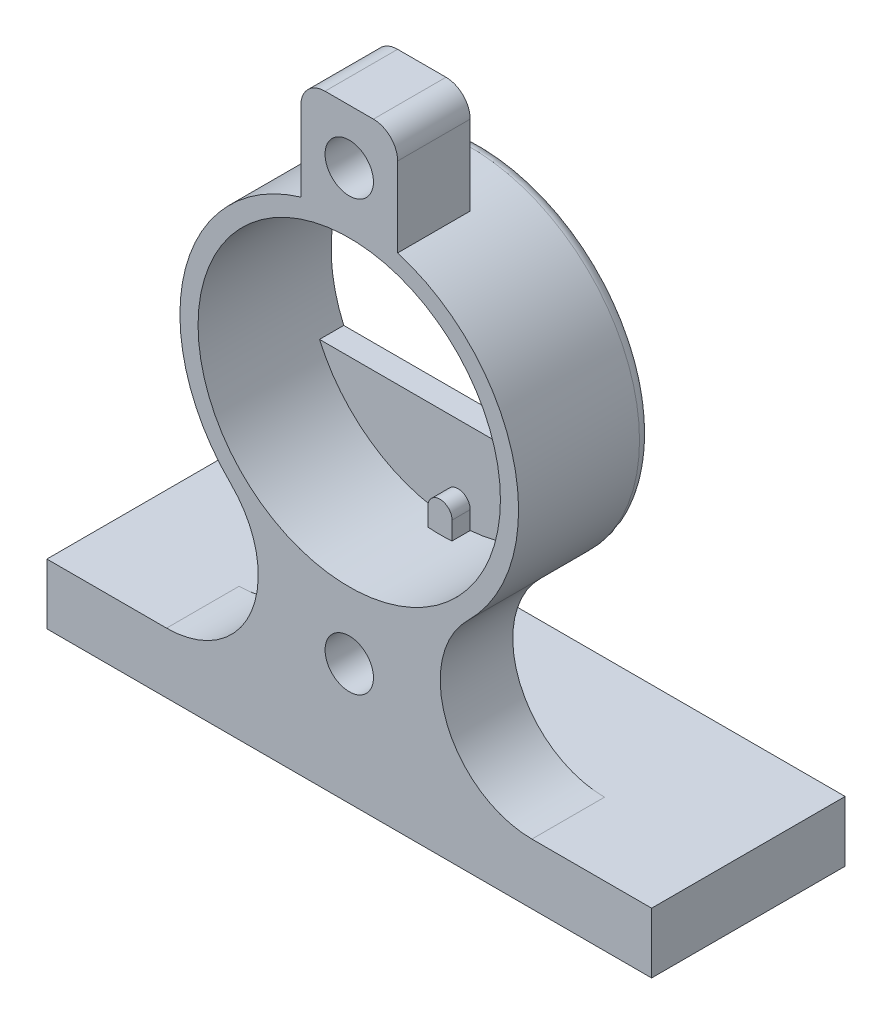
ISO-10303-21;
HEADER;
FILE_DESCRIPTION(('STEP AP214'),'2;1');
FILE_NAME('part.step','',(''),(''),'','','');
FILE_SCHEMA(('AUTOMOTIVE_DESIGN { 1 0 10303 214 1 1 1 1 }'));
ENDSEC;
DATA;
#1=APPLICATION_CONTEXT('core data for automotive mechanical design processes');
#2=APPLICATION_PROTOCOL_DEFINITION('international standard','automotive_design',2000,#1);
#3=PRODUCT_CONTEXT('',#1,'mechanical');
#4=PRODUCT('Part','Part','',(#3));
#5=PRODUCT_RELATED_PRODUCT_CATEGORY('part','',(#4));
#6=PRODUCT_DEFINITION_FORMATION('','',#4);
#7=PRODUCT_DEFINITION_CONTEXT('part definition',#1,'design');
#8=PRODUCT_DEFINITION('design','',#6,#7);
#9=PRODUCT_DEFINITION_SHAPE('','',#8);
#10=(LENGTH_UNIT() NAMED_UNIT(*) SI_UNIT(.MILLI.,.METRE.));
#11=(NAMED_UNIT(*) PLANE_ANGLE_UNIT() SI_UNIT($,.RADIAN.));
#12=(NAMED_UNIT(*) SI_UNIT($,.STERADIAN.) SOLID_ANGLE_UNIT());
#13=UNCERTAINTY_MEASURE_WITH_UNIT(LENGTH_MEASURE(1.E-05),#10,'distance_accuracy_value','');
#14=(GEOMETRIC_REPRESENTATION_CONTEXT(3) GLOBAL_UNCERTAINTY_ASSIGNED_CONTEXT((#13)) GLOBAL_UNIT_ASSIGNED_CONTEXT((#10,
#11,#12)) REPRESENTATION_CONTEXT('',''));
#15=CARTESIAN_POINT('',(0.,0.,0.));
#16=DIRECTION('',(0.,0.,1.));
#17=DIRECTION('',(1.,0.,0.));
#18=AXIS2_PLACEMENT_3D('',#15,#16,#17);
#19=CARTESIAN_POINT('',(0.,0.,5.));
#20=DIRECTION('',(0.,0.,-1.));
#21=DIRECTION('',(-1.,0.,0.));
#22=AXIS2_PLACEMENT_3D('',#19,#20,#21);
#23=PLANE('',#22);
#24=CARTESIAN_POINT('',(0.,-18.,5.));
#25=DIRECTION('',(0.,0.,-1.));
#26=DIRECTION('',(-1.,0.,0.));
#27=AXIS2_PLACEMENT_3D('',#24,#25,#26);
#28=CIRCLE('',#27,3.25);
#29=CARTESIAN_POINT('',(-3.25,-18.,5.));
#30=VERTEX_POINT('',#29);
#31=EDGE_CURVE('E296',#30,#30,#28,.T.);
#32=ORIENTED_EDGE('',*,*,#31,.F.);
#33=EDGE_LOOP('',(#32));
#34=FACE_BOUND('',#33,.T.);
#35=CARTESIAN_POINT('',(15.1051867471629,-15.4166666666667,5.));
#36=DIRECTION('',(0.,0.,-1.));
#37=DIRECTION('',(-1.,0.,0.));
#38=AXIS2_PLACEMENT_3D('',#35,#36,#37);
#39=CIRCLE('',#38,7.58333333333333);
#40=CARTESIAN_POINT('',(9.79795897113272,-10.,5.));
#41=VERTEX_POINT('',#40);
#42=CARTESIAN_POINT('',(15.1051867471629,-23.,5.));
#43=VERTEX_POINT('',#42);
#44=EDGE_CURVE('E355',#41,#43,#39,.F.);
#45=ORIENTED_EDGE('',*,*,#44,.T.);
#46=DIRECTION('',(-1.,0.,0.));
#47=VECTOR('',#46,1.);
#48=CARTESIAN_POINT('',(0.,-23.,5.));
#49=LINE('',#48,#47);
#50=CARTESIAN_POINT('',(-15.1051867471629,-23.,5.));
#51=VERTEX_POINT('',#50);
#52=EDGE_CURVE('E12',#43,#51,#49,.T.);
#53=ORIENTED_EDGE('',*,*,#52,.T.);
#54=CARTESIAN_POINT('',(-15.1051867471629,-15.4166666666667,5.));
#55=DIRECTION('',(0.,0.,-1.));
#56=DIRECTION('',(-1.,0.,0.));
#57=AXIS2_PLACEMENT_3D('',#54,#55,#56);
#58=CIRCLE('',#57,7.58333333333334);
#59=CARTESIAN_POINT('',(-9.79795897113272,-9.99999999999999,5.));
#60=VERTEX_POINT('',#59);
#61=EDGE_CURVE('E353',#51,#60,#58,.F.);
#62=ORIENTED_EDGE('',*,*,#61,.T.);
#63=CARTESIAN_POINT('',(0.,0.,5.));
#64=DIRECTION('',(0.,0.,1.));
#65=DIRECTION('',(-1.,0.,0.));
#66=AXIS2_PLACEMENT_3D('',#63,#64,#65);
#67=CIRCLE('',#66,14.);
#68=EDGE_CURVE('E351',#60,#41,#67,.T.);
#69=ORIENTED_EDGE('',*,*,#68,.T.);
#70=EDGE_LOOP('',(#45,#53,#62,#69));
#71=FACE_BOUND('',#70,.T.);
#72=ADVANCED_FACE('F35',(#34,#71),#23,.T.);
#73=CARTESIAN_POINT('',(0.,0.,-35.3553390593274));
#74=DIRECTION('',(0.,0.,1.));
#75=DIRECTION('',(1.,0.,0.));
#76=AXIS2_PLACEMENT_3D('',#73,#74,#75);
#77=CYLINDRICAL_SURFACE('',#76,12.5);
#78=CARTESIAN_POINT('',(0.,0.,11.));
#79=DIRECTION('',(0.,0.,1.));
#80=DIRECTION('',(1.,0.,0.));
#81=AXIS2_PLACEMENT_3D('',#78,#79,#80);
#82=CIRCLE('',#81,12.5);
#83=CARTESIAN_POINT('',(12.5,0.,11.));
#84=VERTEX_POINT('',#83);
#85=EDGE_CURVE('E415',#84,#84,#82,.T.);
#86=ORIENTED_EDGE('',*,*,#85,.T.);
#87=EDGE_LOOP('',(#86));
#88=FACE_BOUND('',#87,.T.);
#89=DIRECTION('',(0.,0.,1.));
#90=VECTOR('',#89,1.);
#91=CARTESIAN_POINT('',(-1.,12.4599357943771,-35.3553390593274));
#92=LINE('',#91,#90);
#93=CARTESIAN_POINT('',(-1.,12.4599357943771,3.5));
#94=VERTEX_POINT('',#93);
#95=CARTESIAN_POINT('',(-1.,12.4599357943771,2.));
#96=VERTEX_POINT('',#95);
#97=EDGE_CURVE('E55',#94,#96,#92,.F.);
#98=ORIENTED_EDGE('',*,*,#97,.F.);
#99=CARTESIAN_POINT('',(0.,0.,3.5));
#100=DIRECTION('',(0.,0.,1.));
#101=DIRECTION('',(1.,0.,0.));
#102=AXIS2_PLACEMENT_3D('',#99,#100,#101);
#103=CIRCLE('',#102,12.5);
#104=CARTESIAN_POINT('',(1.,12.4599357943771,3.5));
#105=VERTEX_POINT('',#104);
#106=EDGE_CURVE('E50',#94,#105,#103,.F.);
#107=ORIENTED_EDGE('',*,*,#106,.T.);
#108=DIRECTION('',(0.,0.,1.));
#109=VECTOR('',#108,1.);
#110=CARTESIAN_POINT('',(1.,12.4599357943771,-35.3553390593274));
#111=LINE('',#110,#109);
#112=CARTESIAN_POINT('',(1.,12.4599357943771,2.));
#113=VERTEX_POINT('',#112);
#114=EDGE_CURVE('E260',#113,#105,#111,.T.);
#115=ORIENTED_EDGE('',*,*,#114,.F.);
#116=CARTESIAN_POINT('',(0.,0.,2.));
#117=DIRECTION('',(0.,0.,-1.));
#118=DIRECTION('',(-1.,0.,0.));
#119=AXIS2_PLACEMENT_3D('',#116,#117,#118);
#120=CIRCLE('',#119,12.5);
#121=CARTESIAN_POINT('',(11.4564392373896,5.,2.));
#122=VERTEX_POINT('',#121);
#123=EDGE_CURVE('E403',#122,#113,#120,.F.);
#124=ORIENTED_EDGE('',*,*,#123,.F.);
#125=DIRECTION('',(0.,0.,1.));
#126=VECTOR('',#125,1.);
#127=CARTESIAN_POINT('',(11.4564392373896,5.,0.));
#128=LINE('',#127,#126);
#129=CARTESIAN_POINT('',(11.4564392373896,5.,0.));
#130=VERTEX_POINT('',#129);
#131=EDGE_CURVE('E385',#130,#122,#128,.T.);
#132=ORIENTED_EDGE('',*,*,#131,.F.);
#133=CARTESIAN_POINT('',(0.,0.,0.));
#134=DIRECTION('',(0.,0.,1.));
#135=DIRECTION('',(1.,0.,0.));
#136=AXIS2_PLACEMENT_3D('',#133,#134,#135);
#137=CIRCLE('',#136,12.5);
#138=CARTESIAN_POINT('',(11.4564392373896,-5.,0.));
#139=VERTEX_POINT('',#138);
#140=EDGE_CURVE('E365',#139,#130,#137,.T.);
#141=ORIENTED_EDGE('',*,*,#140,.F.);
#142=DIRECTION('',(0.,0.,1.));
#143=VECTOR('',#142,1.);
#144=CARTESIAN_POINT('',(11.4564392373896,-5.,0.));
#145=LINE('',#144,#143);
#146=CARTESIAN_POINT('',(11.4564392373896,-5.,2.));
#147=VERTEX_POINT('',#146);
#148=EDGE_CURVE('E382',#139,#147,#145,.T.);
#149=ORIENTED_EDGE('',*,*,#148,.T.);
#150=CARTESIAN_POINT('',(1.,-12.4599357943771,2.));
#151=VERTEX_POINT('',#150);
#152=EDGE_CURVE('E399',#151,#147,#120,.F.);
#153=ORIENTED_EDGE('',*,*,#152,.F.);
#154=DIRECTION('',(0.,0.,1.));
#155=VECTOR('',#154,1.);
#156=CARTESIAN_POINT('',(1.,-12.4599357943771,-35.3553390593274));
#157=LINE('',#156,#155);
#158=CARTESIAN_POINT('',(1.,-12.4599357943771,3.5));
#159=VERTEX_POINT('',#158);
#160=EDGE_CURVE('E43',#159,#151,#157,.F.);
#161=ORIENTED_EDGE('',*,*,#160,.F.);
#162=CARTESIAN_POINT('',(0.,0.,3.5));
#163=DIRECTION('',(0.,0.,-1.));
#164=DIRECTION('',(-1.,0.,0.));
#165=AXIS2_PLACEMENT_3D('',#162,#163,#164);
#166=CIRCLE('',#165,12.5);
#167=CARTESIAN_POINT('',(-1.,-12.4599357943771,3.5));
#168=VERTEX_POINT('',#167);
#169=EDGE_CURVE('E394',#168,#159,#166,.F.);
#170=ORIENTED_EDGE('',*,*,#169,.F.);
#171=DIRECTION('',(0.,0.,1.));
#172=VECTOR('',#171,1.);
#173=CARTESIAN_POINT('',(-1.,-12.4599357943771,-35.3553390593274));
#174=LINE('',#173,#172);
#175=CARTESIAN_POINT('',(-1.,-12.4599357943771,2.));
#176=VERTEX_POINT('',#175);
#177=EDGE_CURVE('E417',#176,#168,#174,.T.);
#178=ORIENTED_EDGE('',*,*,#177,.F.);
#179=CARTESIAN_POINT('',(-11.4564392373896,-5.,2.));
#180=VERTEX_POINT('',#179);
#181=EDGE_CURVE('E402',#180,#176,#120,.F.);
#182=ORIENTED_EDGE('',*,*,#181,.F.);
#183=DIRECTION('',(0.,0.,1.));
#184=VECTOR('',#183,1.);
#185=CARTESIAN_POINT('',(-11.4564392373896,-5.,0.));
#186=LINE('',#185,#184);
#187=CARTESIAN_POINT('',(-11.4564392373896,-5.,0.));
#188=VERTEX_POINT('',#187);
#189=EDGE_CURVE('E371',#188,#180,#186,.T.);
#190=ORIENTED_EDGE('',*,*,#189,.F.);
#191=CARTESIAN_POINT('',(0.,0.,0.));
#192=DIRECTION('',(0.,0.,1.));
#193=DIRECTION('',(-1.,0.,0.));
#194=AXIS2_PLACEMENT_3D('',#191,#192,#193);
#195=CIRCLE('',#194,12.5);
#196=CARTESIAN_POINT('',(-11.4564392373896,5.,0.));
#197=VERTEX_POINT('',#196);
#198=EDGE_CURVE('E358',#197,#188,#195,.T.);
#199=ORIENTED_EDGE('',*,*,#198,.F.);
#200=DIRECTION('',(0.,0.,1.));
#201=VECTOR('',#200,1.);
#202=CARTESIAN_POINT('',(-11.4564392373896,5.,0.));
#203=LINE('',#202,#201);
#204=CARTESIAN_POINT('',(-11.4564392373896,5.,2.));
#205=VERTEX_POINT('',#204);
#206=EDGE_CURVE('E544',#197,#205,#203,.T.);
#207=ORIENTED_EDGE('',*,*,#206,.T.);
#208=EDGE_CURVE('E413',#96,#205,#120,.F.);
#209=ORIENTED_EDGE('',*,*,#208,.F.);
#210=EDGE_LOOP('',(#98,#107,#115,#124,#132,#141,#149,#153,#161,#170,#178,#182,#190,#199,#207,#209));
#211=FACE_BOUND('',#210,.T.);
#212=ADVANCED_FACE('F444',(#88,#211),#77,.F.);
#213=CARTESIAN_POINT('',(-15.1051867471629,-15.4166666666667,2.));
#214=DIRECTION('',(0.,0.,-1.));
#215=DIRECTION('',(-1.,0.,0.));
#216=AXIS2_PLACEMENT_3D('',#213,#214,#215);
#217=PLANE('',#216);
#218=DIRECTION('',(0.,-1.,0.));
#219=VECTOR('',#218,1.);
#220=CARTESIAN_POINT('',(-1.,13.9642400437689,2.));
#221=LINE('',#220,#219);
#222=CARTESIAN_POINT('',(-1.00000000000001,10.9642400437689,2.));
#223=VERTEX_POINT('',#222);
#224=EDGE_CURVE('E237',#96,#223,#221,.T.);
#225=ORIENTED_EDGE('',*,*,#224,.F.);
#226=ORIENTED_EDGE('',*,*,#208,.T.);
#227=DIRECTION('',(-1.,0.,0.));
#228=VECTOR('',#227,1.);
#229=CARTESIAN_POINT('',(-11.4564392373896,5.,2.));
#230=LINE('',#229,#228);
#231=EDGE_CURVE('E362',#122,#205,#230,.T.);
#232=ORIENTED_EDGE('',*,*,#231,.F.);
#233=ORIENTED_EDGE('',*,*,#123,.T.);
#234=DIRECTION('',(0.,1.,0.));
#235=VECTOR('',#234,1.);
#236=CARTESIAN_POINT('',(1.,13.9642400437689,2.));
#237=LINE('',#236,#235);
#238=CARTESIAN_POINT('',(1.,10.9642400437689,2.));
#239=VERTEX_POINT('',#238);
#240=EDGE_CURVE('E241',#239,#113,#237,.T.);
#241=ORIENTED_EDGE('',*,*,#240,.F.);
#242=CARTESIAN_POINT('',(0.,10.9642400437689,2.));
#243=DIRECTION('',(0.,0.,1.));
#244=DIRECTION('',(1.,0.,0.));
#245=AXIS2_PLACEMENT_3D('',#242,#243,#244);
#246=CIRCLE('',#245,1.);
#247=EDGE_CURVE('E249',#223,#239,#246,.T.);
#248=ORIENTED_EDGE('',*,*,#247,.F.);
#249=EDGE_LOOP('',(#225,#226,#232,#233,#241,#248));
#250=FACE_BOUND('',#249,.T.);
#251=ADVANCED_FACE('F450',(#250),#217,.F.);
#252=DIRECTION('',(0.,1.,0.));
#253=VECTOR('',#252,1.);
#254=CARTESIAN_POINT('',(1.,-13.9642400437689,2.));
#255=LINE('',#254,#253);
#256=CARTESIAN_POINT('',(0.999999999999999,-10.9642400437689,2.));
#257=VERTEX_POINT('',#256);
#258=EDGE_CURVE('E263',#151,#257,#255,.T.);
#259=ORIENTED_EDGE('',*,*,#258,.F.);
#260=ORIENTED_EDGE('',*,*,#152,.T.);
#261=DIRECTION('',(1.,0.,0.));
#262=VECTOR('',#261,1.);
#263=CARTESIAN_POINT('',(-11.4564392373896,-5.,2.));
#264=LINE('',#263,#262);
#265=EDGE_CURVE('E357',#180,#147,#264,.T.);
#266=ORIENTED_EDGE('',*,*,#265,.F.);
#267=ORIENTED_EDGE('',*,*,#181,.T.);
#268=DIRECTION('',(0.,-1.,0.));
#269=VECTOR('',#268,1.);
#270=CARTESIAN_POINT('',(-1.,-13.9642400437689,2.));
#271=LINE('',#270,#269);
#272=CARTESIAN_POINT('',(-0.999999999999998,-10.9642400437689,2.));
#273=VERTEX_POINT('',#272);
#274=EDGE_CURVE('E267',#273,#176,#271,.T.);
#275=ORIENTED_EDGE('',*,*,#274,.F.);
#276=CARTESIAN_POINT('',(0.,-10.9642400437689,2.));
#277=DIRECTION('',(0.,0.,1.));
#278=DIRECTION('',(-1.,0.,0.));
#279=AXIS2_PLACEMENT_3D('',#276,#277,#278);
#280=CIRCLE('',#279,0.999999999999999);
#281=EDGE_CURVE('E275',#257,#273,#280,.T.);
#282=ORIENTED_EDGE('',*,*,#281,.F.);
#283=EDGE_LOOP('',(#259,#260,#266,#267,#275,#282));
#284=FACE_BOUND('',#283,.T.);
#285=ADVANCED_FACE('F468',(#284),#217,.F.);
#286=CARTESIAN_POINT('',(0.,17.5,-6.73362918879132));
#287=DIRECTION('',(0.,0.,1.));
#288=DIRECTION('',(1.,0.,0.));
#289=AXIS2_PLACEMENT_3D('',#286,#287,#288);
#290=CYLINDRICAL_SURFACE('',#289,2.);
#291=CARTESIAN_POINT('',(0.,17.5,11.));
#292=DIRECTION('',(0.,0.,1.));
#293=DIRECTION('',(1.,0.,0.));
#294=AXIS2_PLACEMENT_3D('',#291,#292,#293);
#295=CIRCLE('',#294,2.);
#296=CARTESIAN_POINT('',(2.,17.5,11.));
#297=VERTEX_POINT('',#296);
#298=EDGE_CURVE('E314',#297,#297,#295,.T.);
#299=ORIENTED_EDGE('',*,*,#298,.T.);
#300=EDGE_LOOP('',(#299));
#301=FACE_BOUND('',#300,.T.);
#302=CARTESIAN_POINT('',(0.,17.5,7.));
#303=DIRECTION('',(0.,0.,-1.));
#304=DIRECTION('',(-1.,0.,0.));
#305=AXIS2_PLACEMENT_3D('',#302,#303,#304);
#306=CIRCLE('',#305,2.);
#307=CARTESIAN_POINT('',(-2.,17.5,7.));
#308=VERTEX_POINT('',#307);
#309=EDGE_CURVE('E289',#308,#308,#306,.F.);
#310=ORIENTED_EDGE('',*,*,#309,.F.);
#311=EDGE_LOOP('',(#310));
#312=FACE_BOUND('',#311,.T.);
#313=ADVANCED_FACE('F471',(#301,#312),#290,.F.);
#314=CARTESIAN_POINT('',(0.,-18.,-2.50000000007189E-05));
#315=DIRECTION('',(0.,0.,1.));
#316=DIRECTION('',(1.,0.,0.));
#317=AXIS2_PLACEMENT_3D('',#314,#315,#316);
#318=CYLINDRICAL_SURFACE('',#317,2.);
#319=CARTESIAN_POINT('',(0.,-18.,11.));
#320=DIRECTION('',(0.,0.,1.));
#321=DIRECTION('',(1.,0.,0.));
#322=AXIS2_PLACEMENT_3D('',#319,#320,#321);
#323=CIRCLE('',#322,2.);
#324=CARTESIAN_POINT('',(2.,-18.,11.));
#325=VERTEX_POINT('',#324);
#326=EDGE_CURVE('E301',#325,#325,#323,.T.);
#327=ORIENTED_EDGE('',*,*,#326,.T.);
#328=EDGE_LOOP('',(#327));
#329=FACE_BOUND('',#328,.T.);
#330=CARTESIAN_POINT('',(0.,-18.,7.));
#331=DIRECTION('',(0.,0.,-1.));
#332=DIRECTION('',(-1.,0.,0.));
#333=AXIS2_PLACEMENT_3D('',#330,#331,#332);
#334=CIRCLE('',#333,2.);
#335=CARTESIAN_POINT('',(-2.,-18.,7.));
#336=VERTEX_POINT('',#335);
#337=EDGE_CURVE('E295',#336,#336,#334,.F.);
#338=ORIENTED_EDGE('',*,*,#337,.F.);
#339=EDGE_LOOP('',(#338));
#340=FACE_BOUND('',#339,.T.);
#341=ADVANCED_FACE('F457',(#329,#340),#318,.F.);
#342=CARTESIAN_POINT('',(-25.,-28.,11.));
#343=DIRECTION('',(1.,0.,0.));
#344=DIRECTION('',(0.,0.,-1.));
#345=AXIS2_PLACEMENT_3D('',#342,#343,#344);
#346=PLANE('',#345);
#347=DIRECTION('',(0.,0.,-1.));
#348=VECTOR('',#347,1.);
#349=CARTESIAN_POINT('',(-25.,-23.,11.));
#350=LINE('',#349,#348);
#351=CARTESIAN_POINT('',(-25.,-23.,11.));
#352=VERTEX_POINT('',#351);
#353=CARTESIAN_POINT('',(-25.,-23.,-5.));
#354=VERTEX_POINT('',#353);
#355=EDGE_CURVE('E508',#352,#354,#350,.T.);
#356=ORIENTED_EDGE('',*,*,#355,.T.);
#357=DIRECTION('',(0.,1.,0.));
#358=VECTOR('',#357,1.);
#359=CARTESIAN_POINT('',(-25.,-28.,-5.));
#360=LINE('',#359,#358);
#361=CARTESIAN_POINT('',(-25.,-28.,-5.));
#362=VERTEX_POINT('',#361);
#363=EDGE_CURVE('E227',#362,#354,#360,.T.);
#364=ORIENTED_EDGE('',*,*,#363,.F.);
#365=DIRECTION('',(0.,0.,-1.));
#366=VECTOR('',#365,1.);
#367=CARTESIAN_POINT('',(-25.,-28.,11.));
#368=LINE('',#367,#366);
#369=CARTESIAN_POINT('',(-25.,-28.,11.));
#370=VERTEX_POINT('',#369);
#371=EDGE_CURVE('E217',#370,#362,#368,.T.);
#372=ORIENTED_EDGE('',*,*,#371,.F.);
#373=DIRECTION('',(0.,-1.,0.));
#374=VECTOR('',#373,1.);
#375=CARTESIAN_POINT('',(-25.,-28.,11.));
#376=LINE('',#375,#374);
#377=EDGE_CURVE('E510',#352,#370,#376,.T.);
#378=ORIENTED_EDGE('',*,*,#377,.F.);
#379=EDGE_LOOP('',(#356,#364,#372,#378));
#380=FACE_BOUND('',#379,.T.);
#381=ADVANCED_FACE('F499',(#380),#346,.F.);
#382=CARTESIAN_POINT('',(-25.,-28.,11.));
#383=DIRECTION('',(0.,1.,0.));
#384=DIRECTION('',(-1.,0.,0.));
#385=AXIS2_PLACEMENT_3D('',#382,#383,#384);
#386=PLANE('',#385);
#387=ORIENTED_EDGE('',*,*,#371,.T.);
#388=DIRECTION('',(-1.,0.,0.));
#389=VECTOR('',#388,1.);
#390=CARTESIAN_POINT('',(25.,-28.,-5.));
#391=LINE('',#390,#389);
#392=CARTESIAN_POINT('',(25.,-28.,-5.));
#393=VERTEX_POINT('',#392);
#394=EDGE_CURVE('E221',#393,#362,#391,.T.);
#395=ORIENTED_EDGE('',*,*,#394,.F.);
#396=DIRECTION('',(0.,0.,-1.));
#397=VECTOR('',#396,1.);
#398=CARTESIAN_POINT('',(25.,-28.,11.));
#399=LINE('',#398,#397);
#400=CARTESIAN_POINT('',(25.,-28.,11.));
#401=VERTEX_POINT('',#400);
#402=EDGE_CURVE('E209',#401,#393,#399,.T.);
#403=ORIENTED_EDGE('',*,*,#402,.F.);
#404=DIRECTION('',(1.,0.,0.));
#405=VECTOR('',#404,1.);
#406=CARTESIAN_POINT('',(-25.,-28.,11.));
#407=LINE('',#406,#405);
#408=EDGE_CURVE('E541',#370,#401,#407,.T.);
#409=ORIENTED_EDGE('',*,*,#408,.F.);
#410=EDGE_LOOP('',(#387,#395,#403,#409));
#411=FACE_BOUND('',#410,.T.);
#412=ADVANCED_FACE('F222',(#411),#386,.F.);
#413=CARTESIAN_POINT('',(25.,-28.,11.));
#414=DIRECTION('',(-1.,0.,0.));
#415=DIRECTION('',(0.,0.,1.));
#416=AXIS2_PLACEMENT_3D('',#413,#414,#415);
#417=PLANE('',#416);
#418=ORIENTED_EDGE('',*,*,#402,.T.);
#419=DIRECTION('',(0.,-1.,0.));
#420=VECTOR('',#419,1.);
#421=CARTESIAN_POINT('',(25.,-28.,-5.));
#422=LINE('',#421,#420);
#423=CARTESIAN_POINT('',(25.,-23.,-5.));
#424=VERTEX_POINT('',#423);
#425=EDGE_CURVE('E214',#424,#393,#422,.T.);
#426=ORIENTED_EDGE('',*,*,#425,.F.);
#427=DIRECTION('',(0.,0.,-1.));
#428=VECTOR('',#427,1.);
#429=CARTESIAN_POINT('',(25.,-23.,11.));
#430=LINE('',#429,#428);
#431=CARTESIAN_POINT('',(25.,-23.,11.));
#432=VERTEX_POINT('',#431);
#433=EDGE_CURVE('E218',#432,#424,#430,.T.);
#434=ORIENTED_EDGE('',*,*,#433,.F.);
#435=DIRECTION('',(0.,1.,0.));
#436=VECTOR('',#435,1.);
#437=CARTESIAN_POINT('',(25.,-28.,11.));
#438=LINE('',#437,#436);
#439=EDGE_CURVE('E215',#401,#432,#438,.T.);
#440=ORIENTED_EDGE('',*,*,#439,.F.);
#441=EDGE_LOOP('',(#418,#426,#434,#440));
#442=FACE_BOUND('',#441,.T.);
#443=ADVANCED_FACE('F211',(#442),#417,.F.);
#444=CARTESIAN_POINT('',(15.1051867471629,-15.4166666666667,11.));
#445=DIRECTION('',(0.,0.,-1.));
#446=DIRECTION('',(-1.,0.,0.));
#447=AXIS2_PLACEMENT_3D('',#444,#445,#446);
#448=CYLINDRICAL_SURFACE('',#447,7.58333333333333);
#449=ORIENTED_EDGE('',*,*,#44,.F.);
#450=DIRECTION('',(0.,0.,-1.));
#451=VECTOR('',#450,1.);
#452=CARTESIAN_POINT('',(9.79795897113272,-10.,11.));
#453=LINE('',#452,#451);
#454=CARTESIAN_POINT('',(9.79795897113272,-10.,11.));
#455=VERTEX_POINT('',#454);
#456=EDGE_CURVE('E521',#455,#41,#453,.T.);
#457=ORIENTED_EDGE('',*,*,#456,.F.);
#458=CARTESIAN_POINT('',(15.1051867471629,-15.4166666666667,11.));
#459=DIRECTION('',(0.,0.,-1.));
#460=DIRECTION('',(1.,0.,0.));
#461=AXIS2_PLACEMENT_3D('',#458,#459,#460);
#462=CIRCLE('',#461,7.58333333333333);
#463=CARTESIAN_POINT('',(15.1051867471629,-23.,11.));
#464=VERTEX_POINT('',#463);
#465=EDGE_CURVE('E537',#464,#455,#462,.T.);
#466=ORIENTED_EDGE('',*,*,#465,.F.);
#467=DIRECTION('',(0.,0.,-1.));
#468=VECTOR('',#467,1.);
#469=CARTESIAN_POINT('',(15.1051867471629,-23.,11.));
#470=LINE('',#469,#468);
#471=EDGE_CURVE('E518',#464,#43,#470,.T.);
#472=ORIENTED_EDGE('',*,*,#471,.T.);
#473=EDGE_LOOP('',(#449,#457,#466,#472));
#474=FACE_BOUND('',#473,.T.);
#475=ADVANCED_FACE('F488',(#474),#448,.F.);
#476=CARTESIAN_POINT('',(-15.1051867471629,-15.4166666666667,11.));
#477=DIRECTION('',(0.,0.,-1.));
#478=DIRECTION('',(-1.,0.,0.));
#479=AXIS2_PLACEMENT_3D('',#476,#477,#478);
#480=CYLINDRICAL_SURFACE('',#479,7.58333333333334);
#481=ORIENTED_EDGE('',*,*,#61,.F.);
#482=DIRECTION('',(0.,0.,-1.));
#483=VECTOR('',#482,1.);
#484=CARTESIAN_POINT('',(-15.1051867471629,-23.,11.));
#485=LINE('',#484,#483);
#486=CARTESIAN_POINT('',(-15.1051867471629,-23.,11.));
#487=VERTEX_POINT('',#486);
#488=EDGE_CURVE('E512',#487,#51,#485,.T.);
#489=ORIENTED_EDGE('',*,*,#488,.F.);
#490=CARTESIAN_POINT('',(-15.1051867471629,-15.4166666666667,11.));
#491=DIRECTION('',(0.,0.,-1.));
#492=DIRECTION('',(-1.,0.,0.));
#493=AXIS2_PLACEMENT_3D('',#490,#491,#492);
#494=CIRCLE('',#493,7.58333333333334);
#495=CARTESIAN_POINT('',(-9.79795897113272,-10.,11.));
#496=VERTEX_POINT('',#495);
#497=EDGE_CURVE('E531',#496,#487,#494,.T.);
#498=ORIENTED_EDGE('',*,*,#497,.F.);
#499=DIRECTION('',(0.,0.,-1.));
#500=VECTOR('',#499,1.);
#501=CARTESIAN_POINT('',(-9.79795897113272,-10.,11.));
#502=LINE('',#501,#500);
#503=EDGE_CURVE('E526',#496,#60,#502,.T.);
#504=ORIENTED_EDGE('',*,*,#503,.T.);
#505=EDGE_LOOP('',(#481,#489,#498,#504));
#506=FACE_BOUND('',#505,.T.);
#507=ADVANCED_FACE('F484',(#506),#480,.F.);
#508=CARTESIAN_POINT('',(-25.,-23.,11.));
#509=DIRECTION('',(0.,-1.,0.));
#510=DIRECTION('',(0.,0.,-1.));
#511=AXIS2_PLACEMENT_3D('',#508,#509,#510);
#512=PLANE('',#511);
#513=ORIENTED_EDGE('',*,*,#488,.T.);
#514=ORIENTED_EDGE('',*,*,#52,.F.);
#515=ORIENTED_EDGE('',*,*,#471,.F.);
#516=DIRECTION('',(-1.,0.,0.));
#517=VECTOR('',#516,1.);
#518=CARTESIAN_POINT('',(15.1051867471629,-23.,11.));
#519=LINE('',#518,#517);
#520=EDGE_CURVE('E517',#432,#464,#519,.T.);
#521=ORIENTED_EDGE('',*,*,#520,.F.);
#522=ORIENTED_EDGE('',*,*,#433,.T.);
#523=DIRECTION('',(1.,0.,0.));
#524=VECTOR('',#523,1.);
#525=CARTESIAN_POINT('',(25.,-23.,-5.));
#526=LINE('',#525,#524);
#527=EDGE_CURVE('E232',#354,#424,#526,.T.);
#528=ORIENTED_EDGE('',*,*,#527,.F.);
#529=ORIENTED_EDGE('',*,*,#355,.F.);
#530=DIRECTION('',(-1.,0.,0.));
#531=VECTOR('',#530,1.);
#532=CARTESIAN_POINT('',(-25.,-23.,11.));
#533=LINE('',#532,#531);
#534=EDGE_CURVE('E513',#487,#352,#533,.T.);
#535=ORIENTED_EDGE('',*,*,#534,.F.);
#536=EDGE_LOOP('',(#513,#514,#515,#521,#522,#528,#529,#535));
#537=FACE_BOUND('',#536,.T.);
#538=ADVANCED_FACE('F481',(#537),#512,.F.);
#539=CARTESIAN_POINT('',(0.,0.,11.));
#540=DIRECTION('',(0.,0.,-1.));
#541=DIRECTION('',(-1.,0.,0.));
#542=AXIS2_PLACEMENT_3D('',#539,#540,#541);
#543=CYLINDRICAL_SURFACE('',#542,14.);
#544=CARTESIAN_POINT('',(0.,0.,11.));
#545=DIRECTION('',(0.,0.,1.));
#546=DIRECTION('',(-1.,0.,0.));
#547=AXIS2_PLACEMENT_3D('',#544,#545,#546);
#548=CIRCLE('',#547,14.);
#549=CARTESIAN_POINT('',(-4.,13.4164078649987,11.));
#550=VERTEX_POINT('',#549);
#551=EDGE_CURVE('E536',#550,#496,#548,.T.);
#552=ORIENTED_EDGE('',*,*,#551,.F.);
#553=DIRECTION('',(0.,0.,1.));
#554=VECTOR('',#553,1.);
#555=CARTESIAN_POINT('',(-4.,13.4164078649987,-6.73362918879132));
#556=LINE('',#555,#554);
#557=CARTESIAN_POINT('',(-4.,13.4164078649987,5.));
#558=VERTEX_POINT('',#557);
#559=EDGE_CURVE('E329',#558,#550,#556,.T.);
#560=ORIENTED_EDGE('',*,*,#559,.F.);
#561=CARTESIAN_POINT('',(0.,0.,5.));
#562=DIRECTION('',(0.,0.,-1.));
#563=DIRECTION('',(-1.,0.,0.));
#564=AXIS2_PLACEMENT_3D('',#561,#562,#563);
#565=CIRCLE('',#564,14.);
#566=CARTESIAN_POINT('',(4.,13.4164078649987,5.));
#567=VERTEX_POINT('',#566);
#568=EDGE_CURVE('E322',#558,#567,#565,.T.);
#569=ORIENTED_EDGE('',*,*,#568,.T.);
#570=DIRECTION('',(0.,0.,1.));
#571=VECTOR('',#570,1.);
#572=CARTESIAN_POINT('',(4.,13.4164078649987,-6.73362918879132));
#573=LINE('',#572,#571);
#574=CARTESIAN_POINT('',(4.,13.4164078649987,11.));
#575=VERTEX_POINT('',#574);
#576=EDGE_CURVE('E325',#567,#575,#573,.T.);
#577=ORIENTED_EDGE('',*,*,#576,.T.);
#578=EDGE_CURVE('E533',#455,#575,#548,.T.);
#579=ORIENTED_EDGE('',*,*,#578,.F.);
#580=ORIENTED_EDGE('',*,*,#456,.T.);
#581=ORIENTED_EDGE('',*,*,#68,.F.);
#582=ORIENTED_EDGE('',*,*,#503,.F.);
#583=EDGE_LOOP('',(#552,#560,#569,#577,#579,#580,#581,#582));
#584=FACE_BOUND('',#583,.T.);
#585=CARTESIAN_POINT('',(0.,0.,0.999999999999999));
#586=DIRECTION('',(0.,0.,-1.));
#587=DIRECTION('',(-1.,0.,0.));
#588=AXIS2_PLACEMENT_3D('',#585,#586,#587);
#589=CIRCLE('',#588,14.);
#590=CARTESIAN_POINT('',(-14.,0.,0.999999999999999));
#591=VERTEX_POINT('',#590);
#592=EDGE_CURVE('E388',#591,#591,#589,.F.);
#593=ORIENTED_EDGE('',*,*,#592,.T.);
#594=EDGE_LOOP('',(#593));
#595=FACE_BOUND('',#594,.T.);
#596=ADVANCED_FACE('F476',(#584,#595),#543,.T.);
#597=CARTESIAN_POINT('',(-15.1051867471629,-15.4166666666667,11.));
#598=DIRECTION('',(0.,0.,-1.));
#599=DIRECTION('',(-1.,0.,0.));
#600=AXIS2_PLACEMENT_3D('',#597,#598,#599);
#601=PLANE('',#600);
#602=ORIENTED_EDGE('',*,*,#326,.F.);
#603=EDGE_LOOP('',(#602));
#604=FACE_BOUND('',#603,.T.);
#605=ORIENTED_EDGE('',*,*,#85,.F.);
#606=EDGE_LOOP('',(#605));
#607=FACE_BOUND('',#606,.T.);
#608=ORIENTED_EDGE('',*,*,#377,.T.);
#609=ORIENTED_EDGE('',*,*,#408,.T.);
#610=ORIENTED_EDGE('',*,*,#439,.T.);
#611=ORIENTED_EDGE('',*,*,#520,.T.);
#612=ORIENTED_EDGE('',*,*,#465,.T.);
#613=ORIENTED_EDGE('',*,*,#578,.T.);
#614=DIRECTION('',(0.,1.,0.));
#615=VECTOR('',#614,1.);
#616=CARTESIAN_POINT('',(4.,20.,11.));
#617=LINE('',#616,#615);
#618=CARTESIAN_POINT('',(4.,20.,11.));
#619=VERTEX_POINT('',#618);
#620=EDGE_CURVE('E311',#575,#619,#617,.T.);
#621=ORIENTED_EDGE('',*,*,#620,.T.);
#622=CARTESIAN_POINT('',(2.,20.,11.));
#623=DIRECTION('',(0.,0.,1.));
#624=DIRECTION('',(-1.,0.,0.));
#625=AXIS2_PLACEMENT_3D('',#622,#623,#624);
#626=CIRCLE('',#625,2.);
#627=CARTESIAN_POINT('',(1.99999999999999,22.,11.));
#628=VERTEX_POINT('',#627);
#629=EDGE_CURVE('E308',#619,#628,#626,.T.);
#630=ORIENTED_EDGE('',*,*,#629,.T.);
#631=DIRECTION('',(-1.,0.,0.));
#632=VECTOR('',#631,1.);
#633=CARTESIAN_POINT('',(-1.99999999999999,22.,11.));
#634=LINE('',#633,#632);
#635=CARTESIAN_POINT('',(-1.99999999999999,22.,11.));
#636=VERTEX_POINT('',#635);
#637=EDGE_CURVE('E305',#628,#636,#634,.T.);
#638=ORIENTED_EDGE('',*,*,#637,.T.);
#639=CARTESIAN_POINT('',(-2.,20.,11.));
#640=DIRECTION('',(0.,0.,1.));
#641=DIRECTION('',(-1.,0.,0.));
#642=AXIS2_PLACEMENT_3D('',#639,#640,#641);
#643=CIRCLE('',#642,2.);
#644=CARTESIAN_POINT('',(-4.,20.,11.));
#645=VERTEX_POINT('',#644);
#646=EDGE_CURVE('E302',#636,#645,#643,.T.);
#647=ORIENTED_EDGE('',*,*,#646,.T.);
#648=DIRECTION('',(0.,-1.,0.));
#649=VECTOR('',#648,1.);
#650=CARTESIAN_POINT('',(-4.,13.4164078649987,11.));
#651=LINE('',#650,#649);
#652=EDGE_CURVE('E299',#645,#550,#651,.T.);
#653=ORIENTED_EDGE('',*,*,#652,.T.);
#654=ORIENTED_EDGE('',*,*,#551,.T.);
#655=ORIENTED_EDGE('',*,*,#497,.T.);
#656=ORIENTED_EDGE('',*,*,#534,.T.);
#657=EDGE_LOOP('',(#608,#609,#610,#611,#612,#613,#621,#630,#638,#647,#653,#654,#655,#656));
#658=FACE_BOUND('',#657,.T.);
#659=ORIENTED_EDGE('',*,*,#298,.F.);
#660=EDGE_LOOP('',(#659));
#661=FACE_BOUND('',#660,.T.);
#662=ADVANCED_FACE('F473',(#604,#607,#658,#661),#601,.F.);
#663=CARTESIAN_POINT('',(-15.1051867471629,-15.4166666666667,0.));
#664=DIRECTION('',(0.,0.,-1.));
#665=DIRECTION('',(-1.,0.,0.));
#666=AXIS2_PLACEMENT_3D('',#663,#664,#665);
#667=PLANE('',#666);
#668=CARTESIAN_POINT('',(0.,0.,0.));
#669=DIRECTION('',(0.,0.,-1.));
#670=DIRECTION('',(-1.,0.,0.));
#671=AXIS2_PLACEMENT_3D('',#668,#669,#670);
#672=CIRCLE('',#671,13.);
#673=CARTESIAN_POINT('',(-13.,0.,0.));
#674=VERTEX_POINT('',#673);
#675=EDGE_CURVE('E391',#674,#674,#672,.T.);
#676=ORIENTED_EDGE('',*,*,#675,.T.);
#677=EDGE_LOOP('',(#676));
#678=FACE_BOUND('',#677,.T.);
#679=ORIENTED_EDGE('',*,*,#198,.T.);
#680=DIRECTION('',(1.,0.,0.));
#681=VECTOR('',#680,1.);
#682=CARTESIAN_POINT('',(-11.4564392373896,-5.,0.));
#683=LINE('',#682,#681);
#684=EDGE_CURVE('E361',#188,#139,#683,.T.);
#685=ORIENTED_EDGE('',*,*,#684,.T.);
#686=ORIENTED_EDGE('',*,*,#140,.T.);
#687=DIRECTION('',(-1.,0.,0.));
#688=VECTOR('',#687,1.);
#689=CARTESIAN_POINT('',(-11.4564392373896,5.,0.));
#690=LINE('',#689,#688);
#691=EDGE_CURVE('E368',#130,#197,#690,.T.);
#692=ORIENTED_EDGE('',*,*,#691,.T.);
#693=EDGE_LOOP('',(#679,#685,#686,#692));
#694=FACE_BOUND('',#693,.T.);
#695=ADVANCED_FACE('F463',(#678,#694),#667,.T.);
#696=CARTESIAN_POINT('',(-11.4564392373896,5.,0.));
#697=DIRECTION('',(0.,1.,0.));
#698=DIRECTION('',(0.,0.,1.));
#699=AXIS2_PLACEMENT_3D('',#696,#697,#698);
#700=PLANE('',#699);
#701=ORIENTED_EDGE('',*,*,#231,.T.);
#702=ORIENTED_EDGE('',*,*,#206,.F.);
#703=ORIENTED_EDGE('',*,*,#691,.F.);
#704=ORIENTED_EDGE('',*,*,#131,.T.);
#705=EDGE_LOOP('',(#701,#702,#703,#704));
#706=FACE_BOUND('',#705,.T.);
#707=ADVANCED_FACE('F459',(#706),#700,.F.);
#708=CARTESIAN_POINT('',(-11.4564392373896,-5.,0.));
#709=DIRECTION('',(0.,-1.,0.));
#710=DIRECTION('',(0.,0.,-1.));
#711=AXIS2_PLACEMENT_3D('',#708,#709,#710);
#712=PLANE('',#711);
#713=ORIENTED_EDGE('',*,*,#265,.T.);
#714=ORIENTED_EDGE('',*,*,#148,.F.);
#715=ORIENTED_EDGE('',*,*,#684,.F.);
#716=ORIENTED_EDGE('',*,*,#189,.T.);
#717=EDGE_LOOP('',(#713,#714,#715,#716));
#718=FACE_BOUND('',#717,.T.);
#719=ADVANCED_FACE('F462',(#718),#712,.F.);
#720=CARTESIAN_POINT('',(0.,0.,0.999999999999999));
#721=DIRECTION('',(0.,0.,-1.));
#722=DIRECTION('',(-1.,0.,0.));
#723=AXIS2_PLACEMENT_3D('',#720,#721,#722);
#724=TOROIDAL_SURFACE('',#723,13.,1.);
#725=ORIENTED_EDGE('',*,*,#675,.F.);
#726=EDGE_LOOP('',(#725));
#727=FACE_BOUND('',#726,.T.);
#728=ORIENTED_EDGE('',*,*,#592,.F.);
#729=EDGE_LOOP('',(#728));
#730=FACE_BOUND('',#729,.T.);
#731=ADVANCED_FACE('F37',(#727,#730),#724,.T.);
#732=CARTESIAN_POINT('',(-4.,13.4164078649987,-6.73362918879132));
#733=DIRECTION('',(-1.,0.,0.));
#734=DIRECTION('',(0.,0.,1.));
#735=AXIS2_PLACEMENT_3D('',#732,#733,#734);
#736=PLANE('',#735);
#737=DIRECTION('',(0.,0.,1.));
#738=VECTOR('',#737,1.);
#739=CARTESIAN_POINT('',(-4.,20.,-6.73362918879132));
#740=LINE('',#739,#738);
#741=CARTESIAN_POINT('',(-4.,20.,5.));
#742=VERTEX_POINT('',#741);
#743=EDGE_CURVE('E333',#742,#645,#740,.T.);
#744=ORIENTED_EDGE('',*,*,#743,.F.);
#745=DIRECTION('',(0.,-1.,0.));
#746=VECTOR('',#745,1.);
#747=CARTESIAN_POINT('',(-4.,13.4164078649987,5.));
#748=LINE('',#747,#746);
#749=EDGE_CURVE('E326',#742,#558,#748,.T.);
#750=ORIENTED_EDGE('',*,*,#749,.T.);
#751=ORIENTED_EDGE('',*,*,#559,.T.);
#752=ORIENTED_EDGE('',*,*,#652,.F.);
#753=EDGE_LOOP('',(#744,#750,#751,#752));
#754=FACE_BOUND('',#753,.T.);
#755=ADVANCED_FACE('F627',(#754),#736,.T.);
#756=CARTESIAN_POINT('',(-2.,20.,-6.73362918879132));
#757=DIRECTION('',(0.,0.,1.));
#758=DIRECTION('',(1.,0.,0.));
#759=AXIS2_PLACEMENT_3D('',#756,#757,#758);
#760=CYLINDRICAL_SURFACE('',#759,2.);
#761=DIRECTION('',(0.,0.,1.));
#762=VECTOR('',#761,1.);
#763=CARTESIAN_POINT('',(-1.99999999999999,22.,-6.73362918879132));
#764=LINE('',#763,#762);
#765=CARTESIAN_POINT('',(-1.99999999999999,22.,5.));
#766=VERTEX_POINT('',#765);
#767=EDGE_CURVE('E337',#766,#636,#764,.T.);
#768=ORIENTED_EDGE('',*,*,#767,.F.);
#769=CARTESIAN_POINT('',(-2.,20.,5.));
#770=DIRECTION('',(0.,0.,-1.));
#771=DIRECTION('',(-1.,0.,0.));
#772=AXIS2_PLACEMENT_3D('',#769,#770,#771);
#773=CIRCLE('',#772,2.);
#774=EDGE_CURVE('E330',#766,#742,#773,.F.);
#775=ORIENTED_EDGE('',*,*,#774,.T.);
#776=ORIENTED_EDGE('',*,*,#743,.T.);
#777=ORIENTED_EDGE('',*,*,#646,.F.);
#778=EDGE_LOOP('',(#768,#775,#776,#777));
#779=FACE_BOUND('',#778,.T.);
#780=ADVANCED_FACE('F623',(#779),#760,.T.);
#781=CARTESIAN_POINT('',(-1.99999999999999,22.,-6.73362918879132));
#782=DIRECTION('',(0.,1.,0.));
#783=DIRECTION('',(0.,0.,1.));
#784=AXIS2_PLACEMENT_3D('',#781,#782,#783);
#785=PLANE('',#784);
#786=DIRECTION('',(0.,0.,1.));
#787=VECTOR('',#786,1.);
#788=CARTESIAN_POINT('',(1.99999999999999,22.,-6.73362918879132));
#789=LINE('',#788,#787);
#790=CARTESIAN_POINT('',(1.99999999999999,22.,5.));
#791=VERTEX_POINT('',#790);
#792=EDGE_CURVE('E321',#791,#628,#789,.T.);
#793=ORIENTED_EDGE('',*,*,#792,.F.);
#794=DIRECTION('',(-1.,0.,0.));
#795=VECTOR('',#794,1.);
#796=CARTESIAN_POINT('',(-1.99999999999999,22.,5.));
#797=LINE('',#796,#795);
#798=EDGE_CURVE('E334',#791,#766,#797,.T.);
#799=ORIENTED_EDGE('',*,*,#798,.T.);
#800=ORIENTED_EDGE('',*,*,#767,.T.);
#801=ORIENTED_EDGE('',*,*,#637,.F.);
#802=EDGE_LOOP('',(#793,#799,#800,#801));
#803=FACE_BOUND('',#802,.T.);
#804=ADVANCED_FACE('F619',(#803),#785,.T.);
#805=CARTESIAN_POINT('',(2.,20.,-6.73362918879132));
#806=DIRECTION('',(0.,0.,1.));
#807=DIRECTION('',(1.,0.,0.));
#808=AXIS2_PLACEMENT_3D('',#805,#806,#807);
#809=CYLINDRICAL_SURFACE('',#808,2.);
#810=DIRECTION('',(0.,0.,1.));
#811=VECTOR('',#810,1.);
#812=CARTESIAN_POINT('',(4.,20.,-6.73362918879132));
#813=LINE('',#812,#811);
#814=CARTESIAN_POINT('',(4.,20.,5.));
#815=VERTEX_POINT('',#814);
#816=EDGE_CURVE('E317',#815,#619,#813,.T.);
#817=ORIENTED_EDGE('',*,*,#816,.F.);
#818=CARTESIAN_POINT('',(2.,20.,5.));
#819=DIRECTION('',(0.,0.,-1.));
#820=DIRECTION('',(-1.,0.,0.));
#821=AXIS2_PLACEMENT_3D('',#818,#819,#820);
#822=CIRCLE('',#821,2.);
#823=EDGE_CURVE('E338',#815,#791,#822,.F.);
#824=ORIENTED_EDGE('',*,*,#823,.T.);
#825=ORIENTED_EDGE('',*,*,#792,.T.);
#826=ORIENTED_EDGE('',*,*,#629,.F.);
#827=EDGE_LOOP('',(#817,#824,#825,#826));
#828=FACE_BOUND('',#827,.T.);
#829=ADVANCED_FACE('F615',(#828),#809,.T.);
#830=CARTESIAN_POINT('',(4.,20.,-6.73362918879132));
#831=DIRECTION('',(1.,0.,0.));
#832=DIRECTION('',(0.,1.,0.));
#833=AXIS2_PLACEMENT_3D('',#830,#831,#832);
#834=PLANE('',#833);
#835=ORIENTED_EDGE('',*,*,#576,.F.);
#836=DIRECTION('',(0.,1.,0.));
#837=VECTOR('',#836,1.);
#838=CARTESIAN_POINT('',(4.,20.,5.));
#839=LINE('',#838,#837);
#840=EDGE_CURVE('E318',#567,#815,#839,.T.);
#841=ORIENTED_EDGE('',*,*,#840,.T.);
#842=ORIENTED_EDGE('',*,*,#816,.T.);
#843=ORIENTED_EDGE('',*,*,#620,.F.);
#844=EDGE_LOOP('',(#835,#841,#842,#843));
#845=FACE_BOUND('',#844,.T.);
#846=ADVANCED_FACE('F612',(#845),#834,.T.);
#847=CARTESIAN_POINT('',(0.,0.,5.));
#848=DIRECTION('',(0.,0.,-1.));
#849=DIRECTION('',(-1.,0.,0.));
#850=AXIS2_PLACEMENT_3D('',#847,#848,#849);
#851=PLANE('',#850);
#852=CARTESIAN_POINT('',(0.,17.5,5.));
#853=DIRECTION('',(0.,0.,-1.));
#854=DIRECTION('',(-1.,0.,0.));
#855=AXIS2_PLACEMENT_3D('',#852,#853,#854);
#856=CIRCLE('',#855,3.25);
#857=CARTESIAN_POINT('',(-3.25,17.5,5.));
#858=VERTEX_POINT('',#857);
#859=EDGE_CURVE('E285',#858,#858,#856,.T.);
#860=ORIENTED_EDGE('',*,*,#859,.F.);
#861=EDGE_LOOP('',(#860));
#862=FACE_BOUND('',#861,.T.);
#863=ORIENTED_EDGE('',*,*,#568,.F.);
#864=ORIENTED_EDGE('',*,*,#749,.F.);
#865=ORIENTED_EDGE('',*,*,#774,.F.);
#866=ORIENTED_EDGE('',*,*,#798,.F.);
#867=ORIENTED_EDGE('',*,*,#823,.F.);
#868=ORIENTED_EDGE('',*,*,#840,.F.);
#869=EDGE_LOOP('',(#863,#864,#865,#866,#867,#868));
#870=FACE_BOUND('',#869,.T.);
#871=ADVANCED_FACE('F607',(#862,#870),#851,.T.);
#872=CARTESIAN_POINT('',(0.,-18.,7.));
#873=DIRECTION('',(0.,0.,-1.));
#874=DIRECTION('',(-1.,0.,0.));
#875=AXIS2_PLACEMENT_3D('',#872,#873,#874);
#876=PLANE('',#875);
#877=CARTESIAN_POINT('',(0.,-18.,7.));
#878=DIRECTION('',(0.,0.,-1.));
#879=DIRECTION('',(-1.,0.,0.));
#880=AXIS2_PLACEMENT_3D('',#877,#878,#879);
#881=CIRCLE('',#880,3.25);
#882=CARTESIAN_POINT('',(-3.25,-18.,7.));
#883=VERTEX_POINT('',#882);
#884=EDGE_CURVE('E292',#883,#883,#881,.T.);
#885=ORIENTED_EDGE('',*,*,#884,.T.);
#886=EDGE_LOOP('',(#885));
#887=FACE_BOUND('',#886,.T.);
#888=ORIENTED_EDGE('',*,*,#337,.T.);
#889=EDGE_LOOP('',(#888));
#890=FACE_BOUND('',#889,.T.);
#891=ADVANCED_FACE('F604',(#887,#890),#876,.T.);
#892=CARTESIAN_POINT('',(0.,-18.,7.));
#893=DIRECTION('',(0.,0.,-1.));
#894=DIRECTION('',(-1.,0.,0.));
#895=AXIS2_PLACEMENT_3D('',#892,#893,#894);
#896=CYLINDRICAL_SURFACE('',#895,3.25);
#897=ORIENTED_EDGE('',*,*,#884,.F.);
#898=EDGE_LOOP('',(#897));
#899=FACE_BOUND('',#898,.T.);
#900=ORIENTED_EDGE('',*,*,#31,.T.);
#901=EDGE_LOOP('',(#900));
#902=FACE_BOUND('',#901,.T.);
#903=ADVANCED_FACE('F599',(#899,#902),#896,.F.);
#904=CARTESIAN_POINT('',(0.,17.5,7.));
#905=DIRECTION('',(0.,0.,-1.));
#906=DIRECTION('',(-1.,0.,0.));
#907=AXIS2_PLACEMENT_3D('',#904,#905,#906);
#908=PLANE('',#907);
#909=CARTESIAN_POINT('',(0.,17.5,7.));
#910=DIRECTION('',(0.,0.,-1.));
#911=DIRECTION('',(-1.,0.,0.));
#912=AXIS2_PLACEMENT_3D('',#909,#910,#911);
#913=CIRCLE('',#912,3.25);
#914=CARTESIAN_POINT('',(-3.25,17.5,7.));
#915=VERTEX_POINT('',#914);
#916=EDGE_CURVE('E286',#915,#915,#913,.T.);
#917=ORIENTED_EDGE('',*,*,#916,.T.);
#918=EDGE_LOOP('',(#917));
#919=FACE_BOUND('',#918,.T.);
#920=ORIENTED_EDGE('',*,*,#309,.T.);
#921=EDGE_LOOP('',(#920));
#922=FACE_BOUND('',#921,.T.);
#923=ADVANCED_FACE('F596',(#919,#922),#908,.T.);
#924=CARTESIAN_POINT('',(0.,17.5,7.));
#925=DIRECTION('',(0.,0.,-1.));
#926=DIRECTION('',(-1.,0.,0.));
#927=AXIS2_PLACEMENT_3D('',#924,#925,#926);
#928=CYLINDRICAL_SURFACE('',#927,3.25);
#929=ORIENTED_EDGE('',*,*,#916,.F.);
#930=EDGE_LOOP('',(#929));
#931=FACE_BOUND('',#930,.T.);
#932=ORIENTED_EDGE('',*,*,#859,.T.);
#933=EDGE_LOOP('',(#932));
#934=FACE_BOUND('',#933,.T.);
#935=ADVANCED_FACE('F440',(#931,#934),#928,.F.);
#936=CARTESIAN_POINT('',(1.,-13.9642400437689,3.5));
#937=DIRECTION('',(-1.,0.,0.));
#938=DIRECTION('',(0.,-1.,0.));
#939=AXIS2_PLACEMENT_3D('',#936,#937,#938);
#940=PLANE('',#939);
#941=DIRECTION('',(0.,1.,0.));
#942=VECTOR('',#941,1.);
#943=CARTESIAN_POINT('',(1.,-13.9642400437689,3.5));
#944=LINE('',#943,#942);
#945=CARTESIAN_POINT('',(0.999999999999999,-10.9642400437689,3.5));
#946=VERTEX_POINT('',#945);
#947=EDGE_CURVE('E264',#159,#946,#944,.T.);
#948=ORIENTED_EDGE('',*,*,#947,.F.);
#949=ORIENTED_EDGE('',*,*,#160,.T.);
#950=ORIENTED_EDGE('',*,*,#258,.T.);
#951=DIRECTION('',(0.,0.,-1.));
#952=VECTOR('',#951,1.);
#953=CARTESIAN_POINT('',(0.999999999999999,-10.9642400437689,3.5));
#954=LINE('',#953,#952);
#955=EDGE_CURVE('E282',#946,#257,#954,.T.);
#956=ORIENTED_EDGE('',*,*,#955,.F.);
#957=EDGE_LOOP('',(#948,#949,#950,#956));
#958=FACE_BOUND('',#957,.T.);
#959=ADVANCED_FACE('F427',(#958),#940,.F.);
#960=CARTESIAN_POINT('',(-1.,-13.9642400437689,3.5));
#961=DIRECTION('',(1.,0.,0.));
#962=DIRECTION('',(0.,1.,0.));
#963=AXIS2_PLACEMENT_3D('',#960,#961,#962);
#964=PLANE('',#963);
#965=ORIENTED_EDGE('',*,*,#274,.T.);
#966=ORIENTED_EDGE('',*,*,#177,.T.);
#967=DIRECTION('',(0.,-1.,0.));
#968=VECTOR('',#967,1.);
#969=CARTESIAN_POINT('',(-1.,-13.9642400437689,3.5));
#970=LINE('',#969,#968);
#971=CARTESIAN_POINT('',(-0.999999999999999,-10.9642400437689,3.5));
#972=VERTEX_POINT('',#971);
#973=EDGE_CURVE('E269',#972,#168,#970,.T.);
#974=ORIENTED_EDGE('',*,*,#973,.F.);
#975=DIRECTION('',(0.,0.,-1.));
#976=VECTOR('',#975,1.);
#977=CARTESIAN_POINT('',(-0.999999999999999,-10.9642400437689,3.5));
#978=LINE('',#977,#976);
#979=EDGE_CURVE('E272',#972,#273,#978,.T.);
#980=ORIENTED_EDGE('',*,*,#979,.T.);
#981=EDGE_LOOP('',(#965,#966,#974,#980));
#982=FACE_BOUND('',#981,.T.);
#983=ADVANCED_FACE('F432',(#982),#964,.F.);
#984=CARTESIAN_POINT('',(0.,-10.9642400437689,3.5));
#985=DIRECTION('',(0.,0.,-1.));
#986=DIRECTION('',(-1.,0.,0.));
#987=AXIS2_PLACEMENT_3D('',#984,#985,#986);
#988=PLANE('',#987);
#989=ORIENTED_EDGE('',*,*,#973,.T.);
#990=ORIENTED_EDGE('',*,*,#169,.T.);
#991=ORIENTED_EDGE('',*,*,#947,.T.);
#992=CARTESIAN_POINT('',(0.,-10.9642400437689,3.5));
#993=DIRECTION('',(0.,0.,1.));
#994=DIRECTION('',(-1.,0.,0.));
#995=AXIS2_PLACEMENT_3D('',#992,#993,#994);
#996=CIRCLE('',#995,0.999999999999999);
#997=EDGE_CURVE('E266',#946,#972,#996,.T.);
#998=ORIENTED_EDGE('',*,*,#997,.T.);
#999=EDGE_LOOP('',(#989,#990,#991,#998));
#1000=FACE_BOUND('',#999,.T.);
#1001=ADVANCED_FACE('F424',(#1000),#988,.F.);
#1002=CARTESIAN_POINT('',(0.,-10.9642400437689,3.5));
#1003=DIRECTION('',(0.,0.,-1.));
#1004=DIRECTION('',(-1.,0.,0.));
#1005=AXIS2_PLACEMENT_3D('',#1002,#1003,#1004);
#1006=CYLINDRICAL_SURFACE('',#1005,0.999999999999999);
#1007=ORIENTED_EDGE('',*,*,#281,.T.);
#1008=ORIENTED_EDGE('',*,*,#979,.F.);
#1009=ORIENTED_EDGE('',*,*,#997,.F.);
#1010=ORIENTED_EDGE('',*,*,#955,.T.);
#1011=EDGE_LOOP('',(#1007,#1008,#1009,#1010));
#1012=FACE_BOUND('',#1011,.T.);
#1013=ADVANCED_FACE('F431',(#1012),#1006,.T.);
#1014=CARTESIAN_POINT('',(-1.,13.9642400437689,3.5));
#1015=DIRECTION('',(1.,0.,0.));
#1016=DIRECTION('',(0.,0.,-1.));
#1017=AXIS2_PLACEMENT_3D('',#1014,#1015,#1016);
#1018=PLANE('',#1017);
#1019=DIRECTION('',(0.,-1.,0.));
#1020=VECTOR('',#1019,1.);
#1021=CARTESIAN_POINT('',(-1.,13.9642400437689,3.5));
#1022=LINE('',#1021,#1020);
#1023=CARTESIAN_POINT('',(-1.,10.9642400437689,3.5));
#1024=VERTEX_POINT('',#1023);
#1025=EDGE_CURVE('E238',#94,#1024,#1022,.T.);
#1026=ORIENTED_EDGE('',*,*,#1025,.F.);
#1027=ORIENTED_EDGE('',*,*,#97,.T.);
#1028=ORIENTED_EDGE('',*,*,#224,.T.);
#1029=DIRECTION('',(0.,0.,-1.));
#1030=VECTOR('',#1029,1.);
#1031=CARTESIAN_POINT('',(-1.,10.9642400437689,3.5));
#1032=LINE('',#1031,#1030);
#1033=EDGE_CURVE('E256',#1024,#223,#1032,.T.);
#1034=ORIENTED_EDGE('',*,*,#1033,.F.);
#1035=EDGE_LOOP('',(#1026,#1027,#1028,#1034));
#1036=FACE_BOUND('',#1035,.T.);
#1037=ADVANCED_FACE('F576',(#1036),#1018,.F.);
#1038=CARTESIAN_POINT('',(1.,13.9642400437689,3.5));
#1039=DIRECTION('',(-1.,0.,0.));
#1040=DIRECTION('',(0.,0.,1.));
#1041=AXIS2_PLACEMENT_3D('',#1038,#1039,#1040);
#1042=PLANE('',#1041);
#1043=ORIENTED_EDGE('',*,*,#240,.T.);
#1044=ORIENTED_EDGE('',*,*,#114,.T.);
#1045=DIRECTION('',(0.,1.,0.));
#1046=VECTOR('',#1045,1.);
#1047=CARTESIAN_POINT('',(1.,13.9642400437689,3.5));
#1048=LINE('',#1047,#1046);
#1049=CARTESIAN_POINT('',(0.999999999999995,10.9642400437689,3.5));
#1050=VERTEX_POINT('',#1049);
#1051=EDGE_CURVE('E243',#1050,#105,#1048,.T.);
#1052=ORIENTED_EDGE('',*,*,#1051,.F.);
#1053=DIRECTION('',(0.,0.,-1.));
#1054=VECTOR('',#1053,1.);
#1055=CARTESIAN_POINT('',(0.999999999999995,10.9642400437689,3.5));
#1056=LINE('',#1055,#1054);
#1057=EDGE_CURVE('E246',#1050,#239,#1056,.T.);
#1058=ORIENTED_EDGE('',*,*,#1057,.T.);
#1059=EDGE_LOOP('',(#1043,#1044,#1052,#1058));
#1060=FACE_BOUND('',#1059,.T.);
#1061=ADVANCED_FACE('F568',(#1060),#1042,.F.);
#1062=CARTESIAN_POINT('',(0.,10.9642400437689,3.5));
#1063=DIRECTION('',(0.,0.,1.));
#1064=DIRECTION('',(1.,0.,0.));
#1065=AXIS2_PLACEMENT_3D('',#1062,#1063,#1064);
#1066=PLANE('',#1065);
#1067=ORIENTED_EDGE('',*,*,#106,.F.);
#1068=ORIENTED_EDGE('',*,*,#1025,.T.);
#1069=CARTESIAN_POINT('',(0.,10.9642400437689,3.5));
#1070=DIRECTION('',(0.,0.,1.));
#1071=DIRECTION('',(1.,0.,0.));
#1072=AXIS2_PLACEMENT_3D('',#1069,#1070,#1071);
#1073=CIRCLE('',#1072,1.);
#1074=EDGE_CURVE('E240',#1024,#1050,#1073,.T.);
#1075=ORIENTED_EDGE('',*,*,#1074,.T.);
#1076=ORIENTED_EDGE('',*,*,#1051,.T.);
#1077=EDGE_LOOP('',(#1067,#1068,#1075,#1076));
#1078=FACE_BOUND('',#1077,.T.);
#1079=ADVANCED_FACE('F578',(#1078),#1066,.T.);
#1080=CARTESIAN_POINT('',(0.,10.9642400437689,3.5));
#1081=DIRECTION('',(0.,0.,-1.));
#1082=DIRECTION('',(-1.,0.,0.));
#1083=AXIS2_PLACEMENT_3D('',#1080,#1081,#1082);
#1084=CYLINDRICAL_SURFACE('',#1083,1.);
#1085=ORIENTED_EDGE('',*,*,#247,.T.);
#1086=ORIENTED_EDGE('',*,*,#1057,.F.);
#1087=ORIENTED_EDGE('',*,*,#1074,.F.);
#1088=ORIENTED_EDGE('',*,*,#1033,.T.);
#1089=EDGE_LOOP('',(#1085,#1086,#1087,#1088));
#1090=FACE_BOUND('',#1089,.T.);
#1091=ADVANCED_FACE('F571',(#1090),#1084,.T.);
#1092=CARTESIAN_POINT('',(0.,0.,-5.));
#1093=DIRECTION('',(0.,0.,1.));
#1094=DIRECTION('',(1.,0.,0.));
#1095=AXIS2_PLACEMENT_3D('',#1092,#1093,#1094);
#1096=PLANE('',#1095);
#1097=ORIENTED_EDGE('',*,*,#425,.T.);
#1098=ORIENTED_EDGE('',*,*,#394,.T.);
#1099=ORIENTED_EDGE('',*,*,#363,.T.);
#1100=ORIENTED_EDGE('',*,*,#527,.T.);
#1101=EDGE_LOOP('',(#1097,#1098,#1099,#1100));
#1102=FACE_BOUND('',#1101,.T.);
#1103=ADVANCED_FACE('F230',(#1102),#1096,.F.);
#1104=CLOSED_SHELL('',(#72,#212,#251,#285,#313,#341,#381,#412,#443,#475,#507,#538,#596,#662,
#695,#707,#719,#731,#755,#780,#804,#829,#846,#871,#891,#903,#923,#935,#959,#983,#1001,#1013,
#1037,#1061,#1079,#1091,#1103));
#1105=MANIFOLD_SOLID_BREP('B2',#1104);
#1106=ADVANCED_BREP_SHAPE_REPRESENTATION('',(#18,#1105),#14);
#1107=SHAPE_DEFINITION_REPRESENTATION(#9,#1106);
ENDSEC;
END-ISO-10303-21;
